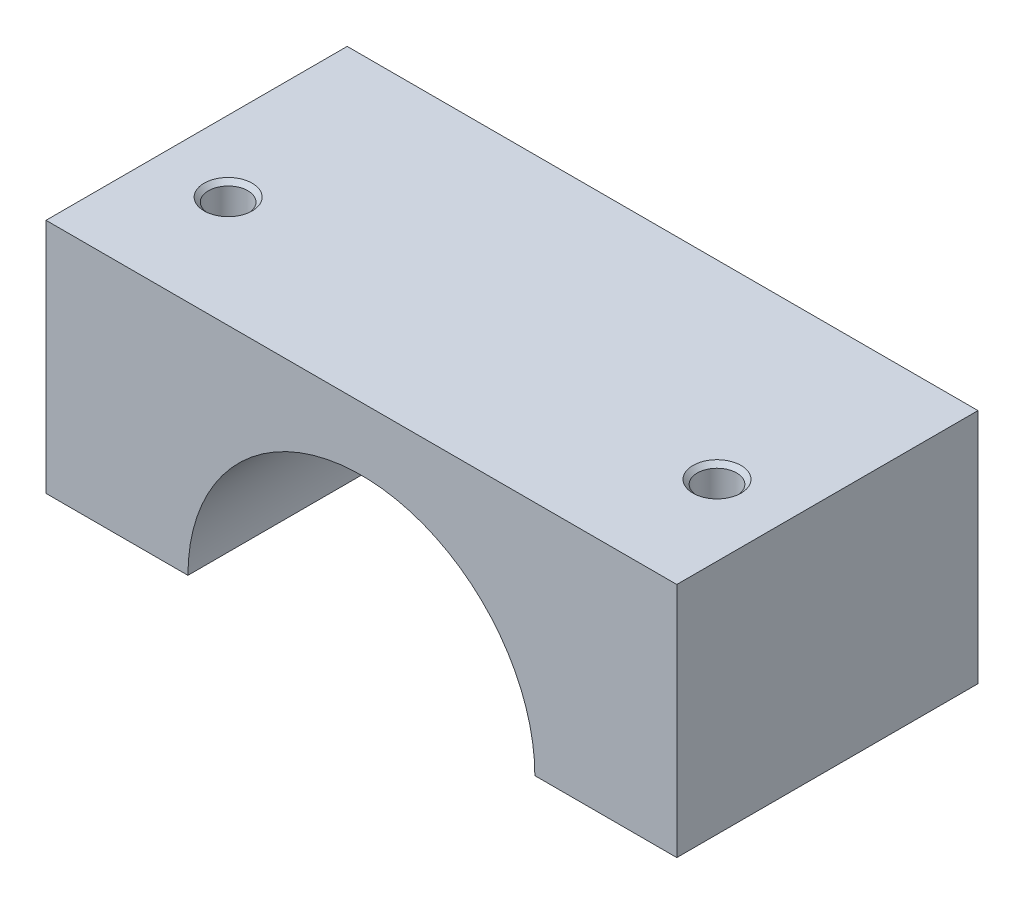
ISO-10303-21;
HEADER;
FILE_DESCRIPTION(('STEP AP214'),'2;1');
FILE_NAME('part.step','',(''),(''),'','','');
FILE_SCHEMA(('AUTOMOTIVE_DESIGN { 1 0 10303 214 1 1 1 1 }'));
ENDSEC;
DATA;
#1=APPLICATION_CONTEXT('core data for automotive mechanical design processes');
#2=APPLICATION_PROTOCOL_DEFINITION('international standard','automotive_design',2000,#1);
#3=PRODUCT_CONTEXT('',#1,'mechanical');
#4=PRODUCT('Part','Part','',(#3));
#5=PRODUCT_RELATED_PRODUCT_CATEGORY('part','',(#4));
#6=PRODUCT_DEFINITION_FORMATION('','',#4);
#7=PRODUCT_DEFINITION_CONTEXT('part definition',#1,'design');
#8=PRODUCT_DEFINITION('design','',#6,#7);
#9=PRODUCT_DEFINITION_SHAPE('','',#8);
#10=(LENGTH_UNIT() NAMED_UNIT(*) SI_UNIT(.MILLI.,.METRE.));
#11=(NAMED_UNIT(*) PLANE_ANGLE_UNIT() SI_UNIT($,.RADIAN.));
#12=(NAMED_UNIT(*) SI_UNIT($,.STERADIAN.) SOLID_ANGLE_UNIT());
#13=UNCERTAINTY_MEASURE_WITH_UNIT(LENGTH_MEASURE(1.E-05),#10,'distance_accuracy_value','');
#14=(GEOMETRIC_REPRESENTATION_CONTEXT(3) GLOBAL_UNCERTAINTY_ASSIGNED_CONTEXT((#13)) GLOBAL_UNIT_ASSIGNED_CONTEXT((#10,
#11,#12)) REPRESENTATION_CONTEXT('',''));
#15=CARTESIAN_POINT('',(0.,0.,0.));
#16=DIRECTION('',(0.,0.,1.));
#17=DIRECTION('',(1.,0.,0.));
#18=AXIS2_PLACEMENT_3D('',#15,#16,#17);
#19=CARTESIAN_POINT('',(0.,0.,19.1));
#20=DIRECTION('',(0.,0.,-1.));
#21=DIRECTION('',(-1.,0.,0.));
#22=AXIS2_PLACEMENT_3D('',#19,#20,#21);
#23=CYLINDRICAL_SURFACE('',#22,11.);
#24=CARTESIAN_POINT('',(0.,0.,0.));
#25=DIRECTION('',(0.,0.,-1.));
#26=DIRECTION('',(1.,0.,0.));
#27=AXIS2_PLACEMENT_3D('',#24,#25,#26);
#28=CIRCLE('',#27,11.);
#29=CARTESIAN_POINT('',(-11.,0.,0.));
#30=VERTEX_POINT('',#29);
#31=CARTESIAN_POINT('',(11.,0.,0.));
#32=VERTEX_POINT('',#31);
#33=EDGE_CURVE('E133',#30,#32,#28,.T.);
#34=ORIENTED_EDGE('',*,*,#33,.T.);
#35=DIRECTION('',(0.,0.,-1.));
#36=VECTOR('',#35,1.);
#37=CARTESIAN_POINT('',(11.,0.,19.1));
#38=LINE('',#37,#36);
#39=CARTESIAN_POINT('',(11.,0.,19.1));
#40=VERTEX_POINT('',#39);
#41=EDGE_CURVE('E11',#40,#32,#38,.T.);
#42=ORIENTED_EDGE('',*,*,#41,.F.);
#43=CARTESIAN_POINT('',(0.,0.,19.1));
#44=DIRECTION('',(0.,0.,-1.));
#45=DIRECTION('',(1.,0.,0.));
#46=AXIS2_PLACEMENT_3D('',#43,#44,#45);
#47=CIRCLE('',#46,11.);
#48=CARTESIAN_POINT('',(-11.,0.,19.1));
#49=VERTEX_POINT('',#48);
#50=EDGE_CURVE('E144',#49,#40,#47,.T.);
#51=ORIENTED_EDGE('',*,*,#50,.F.);
#52=DIRECTION('',(0.,0.,-1.));
#53=VECTOR('',#52,1.);
#54=CARTESIAN_POINT('',(-11.,0.,19.1));
#55=LINE('',#54,#53);
#56=EDGE_CURVE('E129',#49,#30,#55,.T.);
#57=ORIENTED_EDGE('',*,*,#56,.T.);
#58=EDGE_LOOP('',(#34,#42,#51,#57));
#59=FACE_BOUND('',#58,.T.);
#60=ADVANCED_FACE('F47',(#59),#23,.F.);
#61=CARTESIAN_POINT('',(20.,0.,19.1));
#62=DIRECTION('',(0.,1.,0.));
#63=DIRECTION('',(-1.,0.,0.));
#64=AXIS2_PLACEMENT_3D('',#61,#62,#63);
#65=PLANE('',#64);
#66=CARTESIAN_POINT('',(15.5,0.,12.05));
#67=DIRECTION('',(0.,1.,0.));
#68=DIRECTION('',(-1.,0.,0.));
#69=AXIS2_PLACEMENT_3D('',#66,#67,#68);
#70=CIRCLE('',#69,1.24999999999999);
#71=CARTESIAN_POINT('',(14.25,0.,12.05));
#72=VERTEX_POINT('',#71);
#73=EDGE_CURVE('E137',#72,#72,#70,.T.);
#74=ORIENTED_EDGE('',*,*,#73,.T.);
#75=EDGE_LOOP('',(#74));
#76=FACE_BOUND('',#75,.T.);
#77=DIRECTION('',(1.,0.,0.));
#78=VECTOR('',#77,1.);
#79=CARTESIAN_POINT('',(20.,0.,0.));
#80=LINE('',#79,#78);
#81=CARTESIAN_POINT('',(20.,0.,0.));
#82=VERTEX_POINT('',#81);
#83=EDGE_CURVE('E136',#32,#82,#80,.T.);
#84=ORIENTED_EDGE('',*,*,#83,.T.);
#85=DIRECTION('',(0.,0.,-1.));
#86=VECTOR('',#85,1.);
#87=CARTESIAN_POINT('',(20.,0.,19.1));
#88=LINE('',#87,#86);
#89=CARTESIAN_POINT('',(20.,0.,19.1));
#90=VERTEX_POINT('',#89);
#91=EDGE_CURVE('E56',#90,#82,#88,.T.);
#92=ORIENTED_EDGE('',*,*,#91,.F.);
#93=DIRECTION('',(1.,0.,0.));
#94=VECTOR('',#93,1.);
#95=CARTESIAN_POINT('',(20.,0.,19.1));
#96=LINE('',#95,#94);
#97=EDGE_CURVE('E102',#40,#90,#96,.T.);
#98=ORIENTED_EDGE('',*,*,#97,.F.);
#99=ORIENTED_EDGE('',*,*,#41,.T.);
#100=EDGE_LOOP('',(#84,#92,#98,#99));
#101=FACE_BOUND('',#100,.T.);
#102=ADVANCED_FACE('F165',(#76,#101),#65,.F.);
#103=CARTESIAN_POINT('',(20.,15.,19.1));
#104=DIRECTION('',(-1.,0.,0.));
#105=DIRECTION('',(0.,0.,1.));
#106=AXIS2_PLACEMENT_3D('',#103,#104,#105);
#107=PLANE('',#106);
#108=DIRECTION('',(0.,1.,0.));
#109=VECTOR('',#108,1.);
#110=CARTESIAN_POINT('',(20.,15.,0.));
#111=LINE('',#110,#109);
#112=CARTESIAN_POINT('',(20.,15.,0.));
#113=VERTEX_POINT('',#112);
#114=EDGE_CURVE('E139',#82,#113,#111,.T.);
#115=ORIENTED_EDGE('',*,*,#114,.T.);
#116=DIRECTION('',(0.,0.,-1.));
#117=VECTOR('',#116,1.);
#118=CARTESIAN_POINT('',(20.,15.,19.1));
#119=LINE('',#118,#117);
#120=CARTESIAN_POINT('',(20.,15.,19.1));
#121=VERTEX_POINT('',#120);
#122=EDGE_CURVE('E124',#121,#113,#119,.T.);
#123=ORIENTED_EDGE('',*,*,#122,.F.);
#124=DIRECTION('',(0.,1.,0.));
#125=VECTOR('',#124,1.);
#126=CARTESIAN_POINT('',(20.,15.,19.1));
#127=LINE('',#126,#125);
#128=EDGE_CURVE('E115',#90,#121,#127,.T.);
#129=ORIENTED_EDGE('',*,*,#128,.F.);
#130=ORIENTED_EDGE('',*,*,#91,.T.);
#131=EDGE_LOOP('',(#115,#123,#129,#130));
#132=FACE_BOUND('',#131,.T.);
#133=ADVANCED_FACE('F168',(#132),#107,.F.);
#134=CARTESIAN_POINT('',(-20.,15.,19.1));
#135=DIRECTION('',(0.,-1.,0.));
#136=DIRECTION('',(0.,0.,-1.));
#137=AXIS2_PLACEMENT_3D('',#134,#135,#136);
#138=PLANE('',#137);
#139=CARTESIAN_POINT('',(-15.5,15.,12.05));
#140=DIRECTION('',(0.,1.,0.));
#141=DIRECTION('',(0.,0.,1.));
#142=AXIS2_PLACEMENT_3D('',#139,#140,#141);
#143=CIRCLE('',#142,1.525);
#144=CARTESIAN_POINT('',(-15.5,15.,13.575));
#145=VERTEX_POINT('',#144);
#146=EDGE_CURVE('E203',#145,#145,#143,.T.);
#147=ORIENTED_EDGE('',*,*,#146,.F.);
#148=EDGE_LOOP('',(#147));
#149=FACE_BOUND('',#148,.T.);
#150=CARTESIAN_POINT('',(15.5,15.,12.05));
#151=DIRECTION('',(0.,1.,0.));
#152=DIRECTION('',(0.,0.,1.));
#153=AXIS2_PLACEMENT_3D('',#150,#151,#152);
#154=CIRCLE('',#153,1.525);
#155=CARTESIAN_POINT('',(15.5,15.,13.575));
#156=VERTEX_POINT('',#155);
#157=EDGE_CURVE('E154',#156,#156,#154,.T.);
#158=ORIENTED_EDGE('',*,*,#157,.F.);
#159=EDGE_LOOP('',(#158));
#160=FACE_BOUND('',#159,.T.);
#161=DIRECTION('',(-1.,0.,0.));
#162=VECTOR('',#161,1.);
#163=CARTESIAN_POINT('',(-20.,15.,0.));
#164=LINE('',#163,#162);
#165=CARTESIAN_POINT('',(-20.,15.,0.));
#166=VERTEX_POINT('',#165);
#167=EDGE_CURVE('E123',#113,#166,#164,.T.);
#168=ORIENTED_EDGE('',*,*,#167,.T.);
#169=DIRECTION('',(0.,0.,-1.));
#170=VECTOR('',#169,1.);
#171=CARTESIAN_POINT('',(-20.,15.,19.1));
#172=LINE('',#171,#170);
#173=CARTESIAN_POINT('',(-20.,15.,19.1));
#174=VERTEX_POINT('',#173);
#175=EDGE_CURVE('E120',#174,#166,#172,.T.);
#176=ORIENTED_EDGE('',*,*,#175,.F.);
#177=DIRECTION('',(-1.,0.,0.));
#178=VECTOR('',#177,1.);
#179=CARTESIAN_POINT('',(-20.,15.,19.1));
#180=LINE('',#179,#178);
#181=EDGE_CURVE('E109',#121,#174,#180,.T.);
#182=ORIENTED_EDGE('',*,*,#181,.F.);
#183=ORIENTED_EDGE('',*,*,#122,.T.);
#184=EDGE_LOOP('',(#168,#176,#182,#183));
#185=FACE_BOUND('',#184,.T.);
#186=ADVANCED_FACE('F121',(#149,#160,#185),#138,.F.);
#187=CARTESIAN_POINT('',(-20.,0.,19.1));
#188=DIRECTION('',(1.,0.,0.));
#189=DIRECTION('',(0.,0.,-1.));
#190=AXIS2_PLACEMENT_3D('',#187,#188,#189);
#191=PLANE('',#190);
#192=DIRECTION('',(0.,-1.,0.));
#193=VECTOR('',#192,1.);
#194=CARTESIAN_POINT('',(-20.,0.,0.));
#195=LINE('',#194,#193);
#196=CARTESIAN_POINT('',(-20.,0.,0.));
#197=VERTEX_POINT('',#196);
#198=EDGE_CURVE('E88',#166,#197,#195,.T.);
#199=ORIENTED_EDGE('',*,*,#198,.T.);
#200=DIRECTION('',(0.,0.,-1.));
#201=VECTOR('',#200,1.);
#202=CARTESIAN_POINT('',(-20.,0.,19.1));
#203=LINE('',#202,#201);
#204=CARTESIAN_POINT('',(-20.,0.,19.1));
#205=VERTEX_POINT('',#204);
#206=EDGE_CURVE('E125',#205,#197,#203,.T.);
#207=ORIENTED_EDGE('',*,*,#206,.F.);
#208=DIRECTION('',(0.,-1.,0.));
#209=VECTOR('',#208,1.);
#210=CARTESIAN_POINT('',(-20.,0.,19.1));
#211=LINE('',#210,#209);
#212=EDGE_CURVE('E113',#174,#205,#211,.T.);
#213=ORIENTED_EDGE('',*,*,#212,.F.);
#214=ORIENTED_EDGE('',*,*,#175,.T.);
#215=EDGE_LOOP('',(#199,#207,#213,#214));
#216=FACE_BOUND('',#215,.T.);
#217=ADVANCED_FACE('F127',(#216),#191,.F.);
#218=CARTESIAN_POINT('',(-11.,0.,19.1));
#219=DIRECTION('',(0.,1.,0.));
#220=DIRECTION('',(-1.,0.,0.));
#221=AXIS2_PLACEMENT_3D('',#218,#219,#220);
#222=PLANE('',#221);
#223=CARTESIAN_POINT('',(-15.5,0.,12.05));
#224=DIRECTION('',(0.,1.,0.));
#225=DIRECTION('',(-1.,0.,0.));
#226=AXIS2_PLACEMENT_3D('',#223,#224,#225);
#227=CIRCLE('',#226,1.24999999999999);
#228=CARTESIAN_POINT('',(-16.75,0.,12.05));
#229=VERTEX_POINT('',#228);
#230=EDGE_CURVE('E50',#229,#229,#227,.T.);
#231=ORIENTED_EDGE('',*,*,#230,.T.);
#232=EDGE_LOOP('',(#231));
#233=FACE_BOUND('',#232,.T.);
#234=DIRECTION('',(1.,0.,0.));
#235=VECTOR('',#234,1.);
#236=CARTESIAN_POINT('',(-11.,0.,0.));
#237=LINE('',#236,#235);
#238=EDGE_CURVE('E94',#197,#30,#237,.T.);
#239=ORIENTED_EDGE('',*,*,#238,.T.);
#240=ORIENTED_EDGE('',*,*,#56,.F.);
#241=DIRECTION('',(1.,0.,0.));
#242=VECTOR('',#241,1.);
#243=CARTESIAN_POINT('',(-11.,0.,19.1));
#244=LINE('',#243,#242);
#245=EDGE_CURVE('E65',#205,#49,#244,.T.);
#246=ORIENTED_EDGE('',*,*,#245,.F.);
#247=ORIENTED_EDGE('',*,*,#206,.T.);
#248=EDGE_LOOP('',(#239,#240,#246,#247));
#249=FACE_BOUND('',#248,.T.);
#250=ADVANCED_FACE('F173',(#233,#249),#222,.F.);
#251=CARTESIAN_POINT('',(0.,0.,19.1));
#252=DIRECTION('',(0.,0.,1.));
#253=DIRECTION('',(1.,0.,0.));
#254=AXIS2_PLACEMENT_3D('',#251,#252,#253);
#255=PLANE('',#254);
#256=ORIENTED_EDGE('',*,*,#50,.T.);
#257=ORIENTED_EDGE('',*,*,#97,.T.);
#258=ORIENTED_EDGE('',*,*,#128,.T.);
#259=ORIENTED_EDGE('',*,*,#181,.T.);
#260=ORIENTED_EDGE('',*,*,#212,.T.);
#261=ORIENTED_EDGE('',*,*,#245,.T.);
#262=EDGE_LOOP('',(#256,#257,#258,#259,#260,#261));
#263=FACE_BOUND('',#262,.T.);
#264=ADVANCED_FACE('F111',(#263),#255,.T.);
#265=CARTESIAN_POINT('',(0.,0.,0.));
#266=DIRECTION('',(0.,0.,1.));
#267=DIRECTION('',(1.,0.,0.));
#268=AXIS2_PLACEMENT_3D('',#265,#266,#267);
#269=PLANE('',#268);
#270=ORIENTED_EDGE('',*,*,#33,.F.);
#271=ORIENTED_EDGE('',*,*,#238,.F.);
#272=ORIENTED_EDGE('',*,*,#198,.F.);
#273=ORIENTED_EDGE('',*,*,#167,.F.);
#274=ORIENTED_EDGE('',*,*,#114,.F.);
#275=ORIENTED_EDGE('',*,*,#83,.F.);
#276=EDGE_LOOP('',(#270,#271,#272,#273,#274,#275));
#277=FACE_BOUND('',#276,.T.);
#278=ADVANCED_FACE('F171',(#277),#269,.F.);
#279=CARTESIAN_POINT('',(15.5,15.,12.05));
#280=DIRECTION('',(0.,1.,0.));
#281=DIRECTION('',(0.,0.,1.));
#282=AXIS2_PLACEMENT_3D('',#279,#280,#281);
#283=CYLINDRICAL_SURFACE('',#282,1.24999999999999);
#284=CARTESIAN_POINT('',(15.5,14.725,12.05));
#285=DIRECTION('',(0.,1.,0.));
#286=DIRECTION('',(0.,0.,1.));
#287=AXIS2_PLACEMENT_3D('',#284,#285,#286);
#288=CIRCLE('',#287,1.24999999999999);
#289=CARTESIAN_POINT('',(15.5,14.725,13.3));
#290=VERTEX_POINT('',#289);
#291=EDGE_CURVE('E150',#290,#290,#288,.T.);
#292=ORIENTED_EDGE('',*,*,#291,.T.);
#293=EDGE_LOOP('',(#292));
#294=FACE_BOUND('',#293,.T.);
#295=ORIENTED_EDGE('',*,*,#73,.F.);
#296=EDGE_LOOP('',(#295));
#297=FACE_BOUND('',#296,.T.);
#298=ADVANCED_FACE('F209',(#294,#297),#283,.F.);
#299=CARTESIAN_POINT('',(15.5,15.,12.05));
#300=DIRECTION('',(0.,1.,0.));
#301=DIRECTION('',(0.,0.,1.));
#302=AXIS2_PLACEMENT_3D('',#299,#300,#301);
#303=CONICAL_SURFACE('',#302,1.525,0.78539816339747);
#304=ORIENTED_EDGE('',*,*,#291,.F.);
#305=EDGE_LOOP('',(#304));
#306=FACE_BOUND('',#305,.T.);
#307=ORIENTED_EDGE('',*,*,#157,.T.);
#308=EDGE_LOOP('',(#307));
#309=FACE_BOUND('',#308,.T.);
#310=ADVANCED_FACE('F206',(#306,#309),#303,.F.);
#311=CARTESIAN_POINT('',(-15.5,15.,12.05));
#312=DIRECTION('',(0.,1.,0.));
#313=DIRECTION('',(0.,0.,1.));
#314=AXIS2_PLACEMENT_3D('',#311,#312,#313);
#315=CYLINDRICAL_SURFACE('',#314,1.24999999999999);
#316=CARTESIAN_POINT('',(-15.5,14.725,12.05));
#317=DIRECTION('',(0.,1.,0.));
#318=DIRECTION('',(0.,0.,1.));
#319=AXIS2_PLACEMENT_3D('',#316,#317,#318);
#320=CIRCLE('',#319,1.24999999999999);
#321=CARTESIAN_POINT('',(-15.5,14.725,13.3));
#322=VERTEX_POINT('',#321);
#323=EDGE_CURVE('E294',#322,#322,#320,.T.);
#324=ORIENTED_EDGE('',*,*,#323,.T.);
#325=EDGE_LOOP('',(#324));
#326=FACE_BOUND('',#325,.T.);
#327=ORIENTED_EDGE('',*,*,#230,.F.);
#328=EDGE_LOOP('',(#327));
#329=FACE_BOUND('',#328,.T.);
#330=ADVANCED_FACE('F208',(#326,#329),#315,.F.);
#331=CARTESIAN_POINT('',(-15.5,15.,12.05));
#332=DIRECTION('',(0.,1.,0.));
#333=DIRECTION('',(0.,0.,1.));
#334=AXIS2_PLACEMENT_3D('',#331,#332,#333);
#335=CONICAL_SURFACE('',#334,1.525,0.78539816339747);
#336=ORIENTED_EDGE('',*,*,#323,.F.);
#337=EDGE_LOOP('',(#336));
#338=FACE_BOUND('',#337,.T.);
#339=ORIENTED_EDGE('',*,*,#146,.T.);
#340=EDGE_LOOP('',(#339));
#341=FACE_BOUND('',#340,.T.);
#342=ADVANCED_FACE('F216',(#338,#341),#335,.F.);
#343=CLOSED_SHELL('',(#60,#102,#133,#186,#217,#250,#264,#278,#298,#310,#330,#342));
#344=MANIFOLD_SOLID_BREP('B2',#343);
#345=ADVANCED_BREP_SHAPE_REPRESENTATION('',(#18,#344),#14);
#346=SHAPE_DEFINITION_REPRESENTATION(#9,#345);
ENDSEC;
END-ISO-10303-21;
